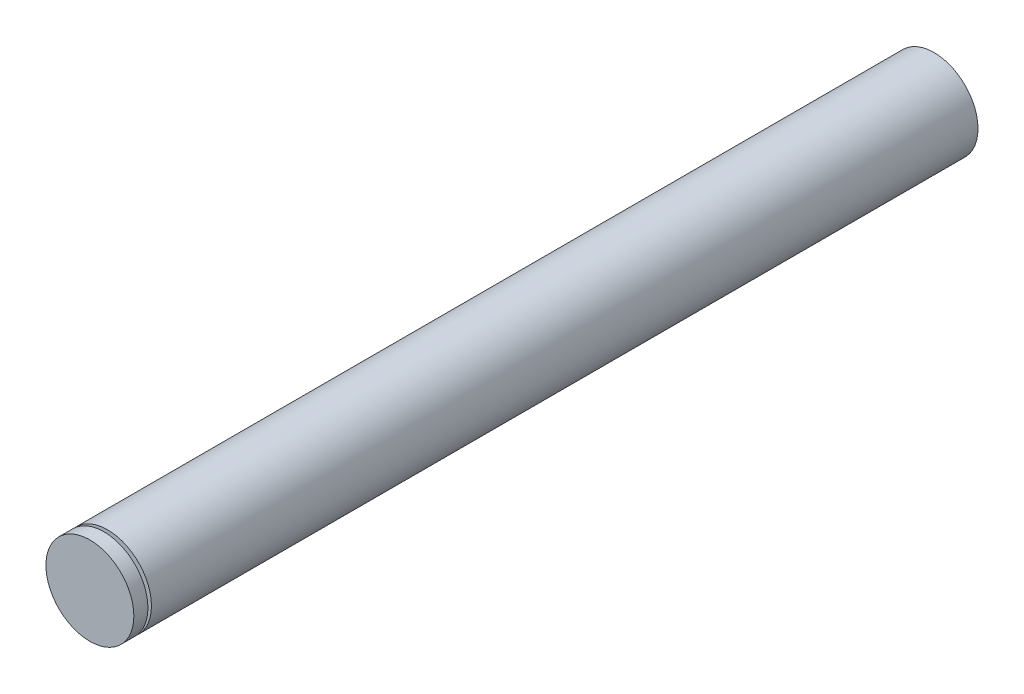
ISO-10303-21;
HEADER;
FILE_DESCRIPTION(('STEP AP214'),'2;1');
FILE_NAME('part.step','',(''),(''),'','','');
FILE_SCHEMA(('AUTOMOTIVE_DESIGN { 1 0 10303 214 1 1 1 1 }'));
ENDSEC;
DATA;
#1=APPLICATION_CONTEXT('core data for automotive mechanical design processes');
#2=APPLICATION_PROTOCOL_DEFINITION('international standard','automotive_design',2000,#1);
#3=PRODUCT_CONTEXT('',#1,'mechanical');
#4=PRODUCT('Part','Part','',(#3));
#5=PRODUCT_RELATED_PRODUCT_CATEGORY('part','',(#4));
#6=PRODUCT_DEFINITION_FORMATION('','',#4);
#7=PRODUCT_DEFINITION_CONTEXT('part definition',#1,'design');
#8=PRODUCT_DEFINITION('design','',#6,#7);
#9=PRODUCT_DEFINITION_SHAPE('','',#8);
#10=(LENGTH_UNIT() NAMED_UNIT(*) SI_UNIT(.MILLI.,.METRE.));
#11=(NAMED_UNIT(*) PLANE_ANGLE_UNIT() SI_UNIT($,.RADIAN.));
#12=(NAMED_UNIT(*) SI_UNIT($,.STERADIAN.) SOLID_ANGLE_UNIT());
#13=UNCERTAINTY_MEASURE_WITH_UNIT(LENGTH_MEASURE(1.E-05),#10,'distance_accuracy_value','');
#14=(GEOMETRIC_REPRESENTATION_CONTEXT(3) GLOBAL_UNCERTAINTY_ASSIGNED_CONTEXT((#13)) GLOBAL_UNIT_ASSIGNED_CONTEXT((#10,
#11,#12)) REPRESENTATION_CONTEXT('',''));
#15=CARTESIAN_POINT('',(0.,0.,0.));
#16=DIRECTION('',(0.,0.,1.));
#17=DIRECTION('',(1.,0.,0.));
#18=AXIS2_PLACEMENT_3D('',#15,#16,#17);
#19=CARTESIAN_POINT('',(0.,0.,480.));
#20=DIRECTION('',(0.,0.,-1.));
#21=DIRECTION('',(-1.,0.,0.));
#22=AXIS2_PLACEMENT_3D('',#19,#20,#21);
#23=CYLINDRICAL_SURFACE('',#22,25.);
#24=CARTESIAN_POINT('',(0.,0.,480.));
#25=DIRECTION('',(0.,0.,1.));
#26=DIRECTION('',(1.,0.,0.));
#27=AXIS2_PLACEMENT_3D('',#24,#25,#26);
#28=CIRCLE('',#27,25.);
#29=CARTESIAN_POINT('',(25.,0.,480.));
#30=VERTEX_POINT('',#29);
#31=EDGE_CURVE('E10',#30,#30,#28,.T.);
#32=ORIENTED_EDGE('',*,*,#31,.F.);
#33=EDGE_LOOP('',(#32));
#34=FACE_BOUND('',#33,.T.);
#35=CARTESIAN_POINT('',(0.,0.,472.));
#36=DIRECTION('',(0.,0.,1.));
#37=DIRECTION('',(1.,0.,0.));
#38=AXIS2_PLACEMENT_3D('',#35,#36,#37);
#39=CIRCLE('',#38,25.);
#40=CARTESIAN_POINT('',(25.,0.,472.));
#41=VERTEX_POINT('',#40);
#42=EDGE_CURVE('E57',#41,#41,#39,.T.);
#43=ORIENTED_EDGE('',*,*,#42,.T.);
#44=EDGE_LOOP('',(#43));
#45=FACE_BOUND('',#44,.T.);
#46=ADVANCED_FACE('F37',(#34,#45),#23,.T.);
#47=CARTESIAN_POINT('',(0.,0.,480.));
#48=DIRECTION('',(0.,0.,1.));
#49=DIRECTION('',(1.,0.,0.));
#50=AXIS2_PLACEMENT_3D('',#47,#48,#49);
#51=PLANE('',#50);
#52=ORIENTED_EDGE('',*,*,#31,.T.);
#53=EDGE_LOOP('',(#52));
#54=FACE_BOUND('',#53,.T.);
#55=ADVANCED_FACE('F65',(#54),#51,.T.);
#56=CARTESIAN_POINT('',(0.,25.,472.));
#57=DIRECTION('',(0.,0.,-1.));
#58=DIRECTION('',(-1.,0.,0.));
#59=AXIS2_PLACEMENT_3D('',#56,#57,#58);
#60=PLANE('',#59);
#61=CARTESIAN_POINT('',(0.,0.,472.));
#62=DIRECTION('',(0.,0.,1.));
#63=DIRECTION('',(1.,0.,0.));
#64=AXIS2_PLACEMENT_3D('',#61,#62,#63);
#65=CIRCLE('',#64,18.);
#66=CARTESIAN_POINT('',(18.,0.,472.));
#67=VERTEX_POINT('',#66);
#68=EDGE_CURVE('E47',#67,#67,#65,.T.);
#69=ORIENTED_EDGE('',*,*,#68,.T.);
#70=EDGE_LOOP('',(#69));
#71=FACE_BOUND('',#70,.T.);
#72=ORIENTED_EDGE('',*,*,#42,.F.);
#73=EDGE_LOOP('',(#72));
#74=FACE_BOUND('',#73,.T.);
#75=ADVANCED_FACE('F62',(#71,#74),#60,.T.);
#76=CARTESIAN_POINT('',(0.,0.,480.));
#77=DIRECTION('',(0.,0.,1.));
#78=DIRECTION('',(1.,0.,0.));
#79=AXIS2_PLACEMENT_3D('',#76,#77,#78);
#80=CYLINDRICAL_SURFACE('',#79,18.);
#81=CARTESIAN_POINT('',(0.,0.,470.));
#82=DIRECTION('',(0.,0.,1.));
#83=DIRECTION('',(1.,0.,0.));
#84=AXIS2_PLACEMENT_3D('',#81,#82,#83);
#85=CIRCLE('',#84,18.);
#86=CARTESIAN_POINT('',(18.,0.,470.));
#87=VERTEX_POINT('',#86);
#88=EDGE_CURVE('E51',#87,#87,#85,.T.);
#89=ORIENTED_EDGE('',*,*,#88,.T.);
#90=EDGE_LOOP('',(#89));
#91=FACE_BOUND('',#90,.T.);
#92=ORIENTED_EDGE('',*,*,#68,.F.);
#93=EDGE_LOOP('',(#92));
#94=FACE_BOUND('',#93,.T.);
#95=ADVANCED_FACE('F64',(#91,#94),#80,.T.);
#96=CARTESIAN_POINT('',(0.,25.,470.));
#97=DIRECTION('',(0.,0.,1.));
#98=DIRECTION('',(1.,0.,0.));
#99=AXIS2_PLACEMENT_3D('',#96,#97,#98);
#100=PLANE('',#99);
#101=CARTESIAN_POINT('',(0.,0.,470.));
#102=DIRECTION('',(0.,0.,1.));
#103=DIRECTION('',(1.,0.,0.));
#104=AXIS2_PLACEMENT_3D('',#101,#102,#103);
#105=CIRCLE('',#104,25.);
#106=CARTESIAN_POINT('',(25.,0.,470.));
#107=VERTEX_POINT('',#106);
#108=EDGE_CURVE('E54',#107,#107,#105,.T.);
#109=ORIENTED_EDGE('',*,*,#108,.T.);
#110=EDGE_LOOP('',(#109));
#111=FACE_BOUND('',#110,.T.);
#112=ORIENTED_EDGE('',*,*,#88,.F.);
#113=EDGE_LOOP('',(#112));
#114=FACE_BOUND('',#113,.T.);
#115=ADVANCED_FACE('F72',(#111,#114),#100,.T.);
#116=CARTESIAN_POINT('',(0.,0.,0.));
#117=DIRECTION('',(0.,0.,1.));
#118=DIRECTION('',(1.,0.,0.));
#119=AXIS2_PLACEMENT_3D('',#116,#117,#118);
#120=PLANE('',#119);
#121=CARTESIAN_POINT('',(0.,0.,0.));
#122=DIRECTION('',(0.,0.,1.));
#123=DIRECTION('',(1.,0.,0.));
#124=AXIS2_PLACEMENT_3D('',#121,#122,#123);
#125=CIRCLE('',#124,25.);
#126=CARTESIAN_POINT('',(25.,0.,0.));
#127=VERTEX_POINT('',#126);
#128=EDGE_CURVE('E40',#127,#127,#125,.T.);
#129=ORIENTED_EDGE('',*,*,#128,.F.);
#130=EDGE_LOOP('',(#129));
#131=FACE_BOUND('',#130,.T.);
#132=ADVANCED_FACE('F84',(#131),#120,.F.);
#133=ORIENTED_EDGE('',*,*,#128,.T.);
#134=EDGE_LOOP('',(#133));
#135=FACE_BOUND('',#134,.T.);
#136=ORIENTED_EDGE('',*,*,#108,.F.);
#137=EDGE_LOOP('',(#136));
#138=FACE_BOUND('',#137,.T.);
#139=ADVANCED_FACE('F79',(#135,#138),#23,.T.);
#140=CLOSED_SHELL('',(#46,#55,#75,#95,#115,#132,#139));
#141=MANIFOLD_SOLID_BREP('B2',#140);
#142=ADVANCED_BREP_SHAPE_REPRESENTATION('',(#18,#141),#14);
#143=SHAPE_DEFINITION_REPRESENTATION(#9,#142);
ENDSEC;
END-ISO-10303-21;
